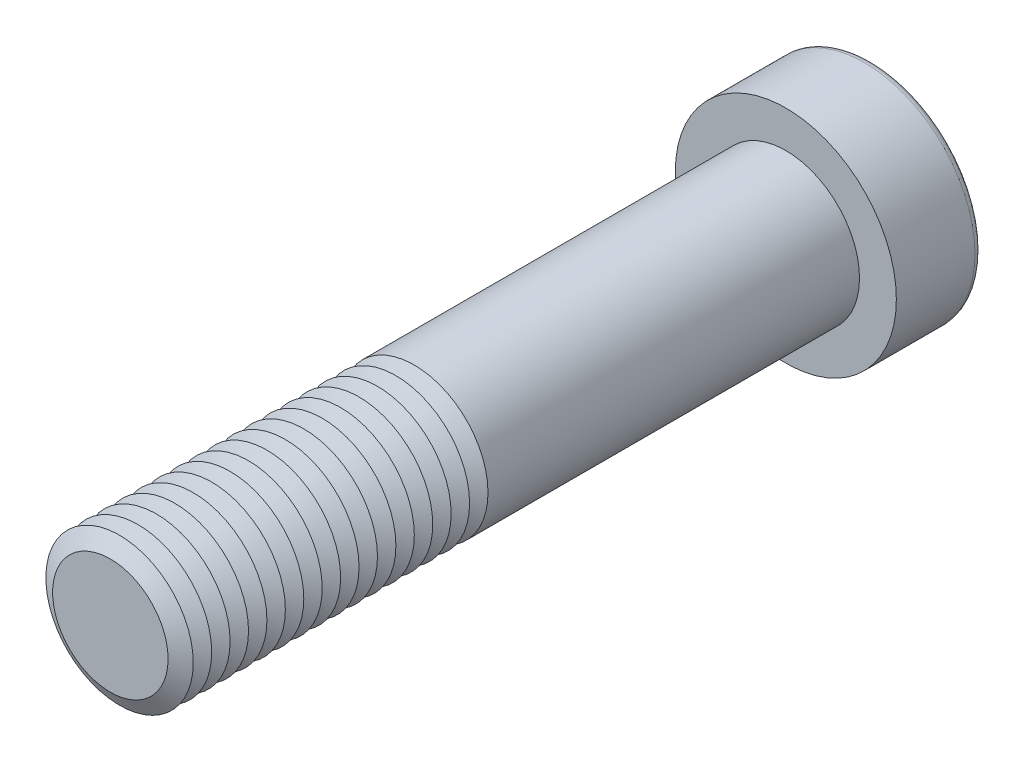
ISO-10303-21;
HEADER;
FILE_DESCRIPTION(('STEP AP214'),'2;1');
FILE_NAME('part.step','',(''),(''),'','','');
FILE_SCHEMA(('AUTOMOTIVE_DESIGN { 1 0 10303 214 1 1 1 1 }'));
ENDSEC;
DATA;
#1=APPLICATION_CONTEXT('core data for automotive mechanical design processes');
#2=APPLICATION_PROTOCOL_DEFINITION('international standard','automotive_design',2000,#1);
#3=PRODUCT_CONTEXT('',#1,'mechanical');
#4=PRODUCT('Part','Part','',(#3));
#5=PRODUCT_RELATED_PRODUCT_CATEGORY('part','',(#4));
#6=PRODUCT_DEFINITION_FORMATION('','',#4);
#7=PRODUCT_DEFINITION_CONTEXT('part definition',#1,'design');
#8=PRODUCT_DEFINITION('design','',#6,#7);
#9=PRODUCT_DEFINITION_SHAPE('','',#8);
#10=(LENGTH_UNIT() NAMED_UNIT(*) SI_UNIT(.MILLI.,.METRE.));
#11=(NAMED_UNIT(*) PLANE_ANGLE_UNIT() SI_UNIT($,.RADIAN.));
#12=(NAMED_UNIT(*) SI_UNIT($,.STERADIAN.) SOLID_ANGLE_UNIT());
#13=UNCERTAINTY_MEASURE_WITH_UNIT(LENGTH_MEASURE(1.E-05),#10,'distance_accuracy_value','');
#14=(GEOMETRIC_REPRESENTATION_CONTEXT(3) GLOBAL_UNCERTAINTY_ASSIGNED_CONTEXT((#13)) GLOBAL_UNIT_ASSIGNED_CONTEXT((#10,
#11,#12)) REPRESENTATION_CONTEXT('',''));
#15=CARTESIAN_POINT('',(0.,0.,0.));
#16=DIRECTION('',(0.,0.,1.));
#17=DIRECTION('',(1.,0.,0.));
#18=AXIS2_PLACEMENT_3D('',#15,#16,#17);
#19=CARTESIAN_POINT('',(0.,0.,99.5));
#20=DIRECTION('',(0.,0.,1.));
#21=DIRECTION('',(1.,0.,0.));
#22=AXIS2_PLACEMENT_3D('',#19,#20,#21);
#23=CONICAL_SURFACE('',#22,12.,1.0471975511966);
#24=CARTESIAN_POINT('',(0.,0.,98.));
#25=DIRECTION('',(0.,0.,1.));
#26=DIRECTION('',(1.,0.,0.));
#27=AXIS2_PLACEMENT_3D('',#24,#25,#26);
#28=CIRCLE('',#27,9.40192378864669);
#29=CARTESIAN_POINT('',(9.40192378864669,0.,98.));
#30=VERTEX_POINT('',#29);
#31=EDGE_CURVE('E312',#30,#30,#28,.T.);
#32=ORIENTED_EDGE('',*,*,#31,.T.);
#33=EDGE_LOOP('',(#32));
#34=FACE_BOUND('',#33,.T.);
#35=CARTESIAN_POINT('',(0.,0.,99.5));
#36=DIRECTION('',(0.,0.,1.));
#37=DIRECTION('',(1.,0.,0.));
#38=AXIS2_PLACEMENT_3D('',#35,#36,#37);
#39=CIRCLE('',#38,12.);
#40=CARTESIAN_POINT('',(12.,0.,99.5));
#41=VERTEX_POINT('',#40);
#42=EDGE_CURVE('E315',#41,#41,#39,.T.);
#43=ORIENTED_EDGE('',*,*,#42,.F.);
#44=EDGE_LOOP('',(#43));
#45=FACE_BOUND('',#44,.T.);
#46=ADVANCED_FACE('F39',(#34,#45),#23,.T.);
#47=CARTESIAN_POINT('',(0.,0.,98.));
#48=DIRECTION('',(0.,0.,-1.));
#49=DIRECTION('',(-1.,0.,0.));
#50=AXIS2_PLACEMENT_3D('',#47,#48,#49);
#51=CONICAL_SURFACE('',#50,9.40192378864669,1.0471975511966);
#52=CARTESIAN_POINT('',(0.,0.,96.5));
#53=DIRECTION('',(0.,0.,1.));
#54=DIRECTION('',(1.,0.,0.));
#55=AXIS2_PLACEMENT_3D('',#52,#53,#54);
#56=CIRCLE('',#55,12.);
#57=CARTESIAN_POINT('',(12.,0.,96.5));
#58=VERTEX_POINT('',#57);
#59=EDGE_CURVE('E323',#58,#58,#56,.T.);
#60=ORIENTED_EDGE('',*,*,#59,.T.);
#61=EDGE_LOOP('',(#60));
#62=FACE_BOUND('',#61,.T.);
#63=ORIENTED_EDGE('',*,*,#31,.F.);
#64=EDGE_LOOP('',(#63));
#65=FACE_BOUND('',#64,.T.);
#66=ADVANCED_FACE('F244',(#62,#65),#51,.T.);
#67=CARTESIAN_POINT('',(0.,0.,110.));
#68=DIRECTION('',(0.,0.,1.));
#69=DIRECTION('',(1.,0.,0.));
#70=AXIS2_PLACEMENT_3D('',#67,#68,#69);
#71=PLANE('',#70);
#72=CARTESIAN_POINT('',(0.,0.,110.));
#73=DIRECTION('',(0.,0.,1.));
#74=DIRECTION('',(1.,0.,0.));
#75=AXIS2_PLACEMENT_3D('',#72,#73,#74);
#76=CIRCLE('',#75,9.40192378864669);
#77=CARTESIAN_POINT('',(9.40192378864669,0.,110.));
#78=VERTEX_POINT('',#77);
#79=EDGE_CURVE('E173',#78,#78,#76,.T.);
#80=ORIENTED_EDGE('',*,*,#79,.T.);
#81=EDGE_LOOP('',(#80));
#82=FACE_BOUND('',#81,.T.);
#83=ADVANCED_FACE('F250',(#82),#71,.T.);
#84=CARTESIAN_POINT('',(0.,0.,110.));
#85=DIRECTION('',(0.,0.,-1.));
#86=DIRECTION('',(-1.,0.,0.));
#87=AXIS2_PLACEMENT_3D('',#84,#85,#86);
#88=CONICAL_SURFACE('',#87,9.40192378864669,1.0471975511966);
#89=CARTESIAN_POINT('',(0.,0.,108.5));
#90=DIRECTION('',(0.,0.,1.));
#91=DIRECTION('',(1.,0.,0.));
#92=AXIS2_PLACEMENT_3D('',#89,#90,#91);
#93=CIRCLE('',#92,12.);
#94=CARTESIAN_POINT('',(12.,0.,108.5));
#95=VERTEX_POINT('',#94);
#96=EDGE_CURVE('E290',#95,#95,#93,.T.);
#97=ORIENTED_EDGE('',*,*,#96,.T.);
#98=EDGE_LOOP('',(#97));
#99=FACE_BOUND('',#98,.T.);
#100=ORIENTED_EDGE('',*,*,#79,.F.);
#101=EDGE_LOOP('',(#100));
#102=FACE_BOUND('',#101,.T.);
#103=ADVANCED_FACE('F198',(#99,#102),#88,.T.);
#104=CARTESIAN_POINT('',(0.,0.,108.5));
#105=DIRECTION('',(0.,0.,1.));
#106=DIRECTION('',(1.,0.,0.));
#107=AXIS2_PLACEMENT_3D('',#104,#105,#106);
#108=CONICAL_SURFACE('',#107,12.,1.0471975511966);
#109=CARTESIAN_POINT('',(0.,0.,107.));
#110=DIRECTION('',(0.,0.,1.));
#111=DIRECTION('',(1.,0.,0.));
#112=AXIS2_PLACEMENT_3D('',#109,#110,#111);
#113=CIRCLE('',#112,9.40192378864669);
#114=CARTESIAN_POINT('',(9.40192378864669,0.,107.));
#115=VERTEX_POINT('',#114);
#116=EDGE_CURVE('E287',#115,#115,#113,.T.);
#117=ORIENTED_EDGE('',*,*,#116,.T.);
#118=EDGE_LOOP('',(#117));
#119=FACE_BOUND('',#118,.T.);
#120=ORIENTED_EDGE('',*,*,#96,.F.);
#121=EDGE_LOOP('',(#120));
#122=FACE_BOUND('',#121,.T.);
#123=ADVANCED_FACE('F276',(#119,#122),#108,.T.);
#124=CARTESIAN_POINT('',(0.,0.,107.));
#125=DIRECTION('',(0.,0.,-1.));
#126=DIRECTION('',(-1.,0.,0.));
#127=AXIS2_PLACEMENT_3D('',#124,#125,#126);
#128=CONICAL_SURFACE('',#127,9.40192378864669,1.0471975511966);
#129=CARTESIAN_POINT('',(0.,0.,105.5));
#130=DIRECTION('',(0.,0.,1.));
#131=DIRECTION('',(1.,0.,0.));
#132=AXIS2_PLACEMENT_3D('',#129,#130,#131);
#133=CIRCLE('',#132,12.);
#134=CARTESIAN_POINT('',(12.,0.,105.5));
#135=VERTEX_POINT('',#134);
#136=EDGE_CURVE('E298',#135,#135,#133,.T.);
#137=ORIENTED_EDGE('',*,*,#136,.T.);
#138=EDGE_LOOP('',(#137));
#139=FACE_BOUND('',#138,.T.);
#140=ORIENTED_EDGE('',*,*,#116,.F.);
#141=EDGE_LOOP('',(#140));
#142=FACE_BOUND('',#141,.T.);
#143=ADVANCED_FACE('F273',(#139,#142),#128,.T.);
#144=CARTESIAN_POINT('',(0.,0.,105.5));
#145=DIRECTION('',(0.,0.,1.));
#146=DIRECTION('',(1.,0.,0.));
#147=AXIS2_PLACEMENT_3D('',#144,#145,#146);
#148=CONICAL_SURFACE('',#147,12.,1.0471975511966);
#149=CARTESIAN_POINT('',(0.,0.,104.));
#150=DIRECTION('',(0.,0.,1.));
#151=DIRECTION('',(1.,0.,0.));
#152=AXIS2_PLACEMENT_3D('',#149,#150,#151);
#153=CIRCLE('',#152,9.40192378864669);
#154=CARTESIAN_POINT('',(9.40192378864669,0.,104.));
#155=VERTEX_POINT('',#154);
#156=EDGE_CURVE('E292',#155,#155,#153,.T.);
#157=ORIENTED_EDGE('',*,*,#156,.T.);
#158=EDGE_LOOP('',(#157));
#159=FACE_BOUND('',#158,.T.);
#160=ORIENTED_EDGE('',*,*,#136,.F.);
#161=EDGE_LOOP('',(#160));
#162=FACE_BOUND('',#161,.T.);
#163=ADVANCED_FACE('F269',(#159,#162),#148,.T.);
#164=CARTESIAN_POINT('',(0.,0.,104.));
#165=DIRECTION('',(0.,0.,-1.));
#166=DIRECTION('',(-1.,0.,0.));
#167=AXIS2_PLACEMENT_3D('',#164,#165,#166);
#168=CONICAL_SURFACE('',#167,9.40192378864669,1.0471975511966);
#169=CARTESIAN_POINT('',(0.,0.,102.5));
#170=DIRECTION('',(0.,0.,1.));
#171=DIRECTION('',(1.,0.,0.));
#172=AXIS2_PLACEMENT_3D('',#169,#170,#171);
#173=CIRCLE('',#172,12.);
#174=CARTESIAN_POINT('',(12.,0.,102.5));
#175=VERTEX_POINT('',#174);
#176=EDGE_CURVE('E308',#175,#175,#173,.T.);
#177=ORIENTED_EDGE('',*,*,#176,.T.);
#178=EDGE_LOOP('',(#177));
#179=FACE_BOUND('',#178,.T.);
#180=ORIENTED_EDGE('',*,*,#156,.F.);
#181=EDGE_LOOP('',(#180));
#182=FACE_BOUND('',#181,.T.);
#183=ADVANCED_FACE('F265',(#179,#182),#168,.T.);
#184=CARTESIAN_POINT('',(0.,0.,102.5));
#185=DIRECTION('',(0.,0.,1.));
#186=DIRECTION('',(1.,0.,0.));
#187=AXIS2_PLACEMENT_3D('',#184,#185,#186);
#188=CONICAL_SURFACE('',#187,12.,1.0471975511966);
#189=CARTESIAN_POINT('',(0.,0.,101.));
#190=DIRECTION('',(0.,0.,1.));
#191=DIRECTION('',(1.,0.,0.));
#192=AXIS2_PLACEMENT_3D('',#189,#190,#191);
#193=CIRCLE('',#192,9.40192378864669);
#194=CARTESIAN_POINT('',(9.40192378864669,0.,101.));
#195=VERTEX_POINT('',#194);
#196=EDGE_CURVE('E304',#195,#195,#193,.T.);
#197=ORIENTED_EDGE('',*,*,#196,.T.);
#198=EDGE_LOOP('',(#197));
#199=FACE_BOUND('',#198,.T.);
#200=ORIENTED_EDGE('',*,*,#176,.F.);
#201=EDGE_LOOP('',(#200));
#202=FACE_BOUND('',#201,.T.);
#203=ADVANCED_FACE('F261',(#199,#202),#188,.T.);
#204=CARTESIAN_POINT('',(0.,0.,101.));
#205=DIRECTION('',(0.,0.,-1.));
#206=DIRECTION('',(-1.,0.,0.));
#207=AXIS2_PLACEMENT_3D('',#204,#205,#206);
#208=CONICAL_SURFACE('',#207,9.40192378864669,1.0471975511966);
#209=ORIENTED_EDGE('',*,*,#42,.T.);
#210=EDGE_LOOP('',(#209));
#211=FACE_BOUND('',#210,.T.);
#212=ORIENTED_EDGE('',*,*,#196,.F.);
#213=EDGE_LOOP('',(#212));
#214=FACE_BOUND('',#213,.T.);
#215=ADVANCED_FACE('F257',(#211,#214),#208,.T.);
#216=CARTESIAN_POINT('',(0.,0.,96.5));
#217=DIRECTION('',(0.,0.,1.));
#218=DIRECTION('',(1.,0.,0.));
#219=AXIS2_PLACEMENT_3D('',#216,#217,#218);
#220=CONICAL_SURFACE('',#219,12.,1.0471975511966);
#221=CARTESIAN_POINT('',(0.,0.,95.));
#222=DIRECTION('',(0.,0.,1.));
#223=DIRECTION('',(1.,0.,0.));
#224=AXIS2_PLACEMENT_3D('',#221,#222,#223);
#225=CIRCLE('',#224,9.40192378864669);
#226=CARTESIAN_POINT('',(9.40192378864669,0.,95.));
#227=VERTEX_POINT('',#226);
#228=EDGE_CURVE('E319',#227,#227,#225,.T.);
#229=ORIENTED_EDGE('',*,*,#228,.T.);
#230=EDGE_LOOP('',(#229));
#231=FACE_BOUND('',#230,.T.);
#232=ORIENTED_EDGE('',*,*,#59,.F.);
#233=EDGE_LOOP('',(#232));
#234=FACE_BOUND('',#233,.T.);
#235=ADVANCED_FACE('F260',(#231,#234),#220,.T.);
#236=CARTESIAN_POINT('',(0.,0.,95.));
#237=DIRECTION('',(0.,0.,-1.));
#238=DIRECTION('',(-1.,0.,0.));
#239=AXIS2_PLACEMENT_3D('',#236,#237,#238);
#240=CONICAL_SURFACE('',#239,9.40192378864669,1.0471975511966);
#241=CARTESIAN_POINT('',(0.,0.,93.5));
#242=DIRECTION('',(0.,0.,1.));
#243=DIRECTION('',(1.,0.,0.));
#244=AXIS2_PLACEMENT_3D('',#241,#242,#243);
#245=CIRCLE('',#244,12.);
#246=CARTESIAN_POINT('',(12.,0.,93.5));
#247=VERTEX_POINT('',#246);
#248=EDGE_CURVE('E331',#247,#247,#245,.T.);
#249=ORIENTED_EDGE('',*,*,#248,.T.);
#250=EDGE_LOOP('',(#249));
#251=FACE_BOUND('',#250,.T.);
#252=ORIENTED_EDGE('',*,*,#228,.F.);
#253=EDGE_LOOP('',(#252));
#254=FACE_BOUND('',#253,.T.);
#255=ADVANCED_FACE('F512',(#251,#254),#240,.T.);
#256=CARTESIAN_POINT('',(0.,0.,93.5));
#257=DIRECTION('',(0.,0.,1.));
#258=DIRECTION('',(1.,0.,0.));
#259=AXIS2_PLACEMENT_3D('',#256,#257,#258);
#260=CONICAL_SURFACE('',#259,12.,1.0471975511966);
#261=CARTESIAN_POINT('',(0.,0.,92.));
#262=DIRECTION('',(0.,0.,1.));
#263=DIRECTION('',(1.,0.,0.));
#264=AXIS2_PLACEMENT_3D('',#261,#262,#263);
#265=CIRCLE('',#264,9.40192378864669);
#266=CARTESIAN_POINT('',(9.40192378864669,0.,92.));
#267=VERTEX_POINT('',#266);
#268=EDGE_CURVE('E327',#267,#267,#265,.T.);
#269=ORIENTED_EDGE('',*,*,#268,.T.);
#270=EDGE_LOOP('',(#269));
#271=FACE_BOUND('',#270,.T.);
#272=ORIENTED_EDGE('',*,*,#248,.F.);
#273=EDGE_LOOP('',(#272));
#274=FACE_BOUND('',#273,.T.);
#275=ADVANCED_FACE('F508',(#271,#274),#260,.T.);
#276=CARTESIAN_POINT('',(0.,0.,92.));
#277=DIRECTION('',(0.,0.,-1.));
#278=DIRECTION('',(-1.,0.,0.));
#279=AXIS2_PLACEMENT_3D('',#276,#277,#278);
#280=CONICAL_SURFACE('',#279,9.40192378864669,1.0471975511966);
#281=CARTESIAN_POINT('',(0.,0.,90.5));
#282=DIRECTION('',(0.,0.,1.));
#283=DIRECTION('',(1.,0.,0.));
#284=AXIS2_PLACEMENT_3D('',#281,#282,#283);
#285=CIRCLE('',#284,12.);
#286=CARTESIAN_POINT('',(12.,0.,90.5));
#287=VERTEX_POINT('',#286);
#288=EDGE_CURVE('E339',#287,#287,#285,.T.);
#289=ORIENTED_EDGE('',*,*,#288,.T.);
#290=EDGE_LOOP('',(#289));
#291=FACE_BOUND('',#290,.T.);
#292=ORIENTED_EDGE('',*,*,#268,.F.);
#293=EDGE_LOOP('',(#292));
#294=FACE_BOUND('',#293,.T.);
#295=ADVANCED_FACE('F504',(#291,#294),#280,.T.);
#296=CARTESIAN_POINT('',(0.,0.,90.5));
#297=DIRECTION('',(0.,0.,1.));
#298=DIRECTION('',(1.,0.,0.));
#299=AXIS2_PLACEMENT_3D('',#296,#297,#298);
#300=CONICAL_SURFACE('',#299,12.,1.0471975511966);
#301=CARTESIAN_POINT('',(0.,0.,89.));
#302=DIRECTION('',(0.,0.,1.));
#303=DIRECTION('',(1.,0.,0.));
#304=AXIS2_PLACEMENT_3D('',#301,#302,#303);
#305=CIRCLE('',#304,9.40192378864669);
#306=CARTESIAN_POINT('',(9.40192378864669,0.,89.));
#307=VERTEX_POINT('',#306);
#308=EDGE_CURVE('E335',#307,#307,#305,.T.);
#309=ORIENTED_EDGE('',*,*,#308,.T.);
#310=EDGE_LOOP('',(#309));
#311=FACE_BOUND('',#310,.T.);
#312=ORIENTED_EDGE('',*,*,#288,.F.);
#313=EDGE_LOOP('',(#312));
#314=FACE_BOUND('',#313,.T.);
#315=ADVANCED_FACE('F500',(#311,#314),#300,.T.);
#316=CARTESIAN_POINT('',(0.,0.,89.));
#317=DIRECTION('',(0.,0.,-1.));
#318=DIRECTION('',(-1.,0.,0.));
#319=AXIS2_PLACEMENT_3D('',#316,#317,#318);
#320=CONICAL_SURFACE('',#319,9.40192378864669,1.0471975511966);
#321=CARTESIAN_POINT('',(0.,0.,87.5));
#322=DIRECTION('',(0.,0.,1.));
#323=DIRECTION('',(1.,0.,0.));
#324=AXIS2_PLACEMENT_3D('',#321,#322,#323);
#325=CIRCLE('',#324,12.);
#326=CARTESIAN_POINT('',(12.,0.,87.5));
#327=VERTEX_POINT('',#326);
#328=EDGE_CURVE('E347',#327,#327,#325,.T.);
#329=ORIENTED_EDGE('',*,*,#328,.T.);
#330=EDGE_LOOP('',(#329));
#331=FACE_BOUND('',#330,.T.);
#332=ORIENTED_EDGE('',*,*,#308,.F.);
#333=EDGE_LOOP('',(#332));
#334=FACE_BOUND('',#333,.T.);
#335=ADVANCED_FACE('F496',(#331,#334),#320,.T.);
#336=CARTESIAN_POINT('',(0.,0.,87.5));
#337=DIRECTION('',(0.,0.,1.));
#338=DIRECTION('',(1.,0.,0.));
#339=AXIS2_PLACEMENT_3D('',#336,#337,#338);
#340=CONICAL_SURFACE('',#339,12.,1.0471975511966);
#341=CARTESIAN_POINT('',(0.,0.,86.));
#342=DIRECTION('',(0.,0.,1.));
#343=DIRECTION('',(1.,0.,0.));
#344=AXIS2_PLACEMENT_3D('',#341,#342,#343);
#345=CIRCLE('',#344,9.40192378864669);
#346=CARTESIAN_POINT('',(9.40192378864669,0.,86.));
#347=VERTEX_POINT('',#346);
#348=EDGE_CURVE('E343',#347,#347,#345,.T.);
#349=ORIENTED_EDGE('',*,*,#348,.T.);
#350=EDGE_LOOP('',(#349));
#351=FACE_BOUND('',#350,.T.);
#352=ORIENTED_EDGE('',*,*,#328,.F.);
#353=EDGE_LOOP('',(#352));
#354=FACE_BOUND('',#353,.T.);
#355=ADVANCED_FACE('F492',(#351,#354),#340,.T.);
#356=CARTESIAN_POINT('',(0.,0.,86.));
#357=DIRECTION('',(0.,0.,-1.));
#358=DIRECTION('',(-1.,0.,0.));
#359=AXIS2_PLACEMENT_3D('',#356,#357,#358);
#360=CONICAL_SURFACE('',#359,9.40192378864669,1.0471975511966);
#361=CARTESIAN_POINT('',(0.,0.,84.5));
#362=DIRECTION('',(0.,0.,1.));
#363=DIRECTION('',(1.,0.,0.));
#364=AXIS2_PLACEMENT_3D('',#361,#362,#363);
#365=CIRCLE('',#364,12.);
#366=CARTESIAN_POINT('',(12.,0.,84.5));
#367=VERTEX_POINT('',#366);
#368=EDGE_CURVE('E355',#367,#367,#365,.T.);
#369=ORIENTED_EDGE('',*,*,#368,.T.);
#370=EDGE_LOOP('',(#369));
#371=FACE_BOUND('',#370,.T.);
#372=ORIENTED_EDGE('',*,*,#348,.F.);
#373=EDGE_LOOP('',(#372));
#374=FACE_BOUND('',#373,.T.);
#375=ADVANCED_FACE('F488',(#371,#374),#360,.T.);
#376=CARTESIAN_POINT('',(0.,0.,84.5));
#377=DIRECTION('',(0.,0.,1.));
#378=DIRECTION('',(1.,0.,0.));
#379=AXIS2_PLACEMENT_3D('',#376,#377,#378);
#380=CONICAL_SURFACE('',#379,12.,1.0471975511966);
#381=CARTESIAN_POINT('',(0.,0.,83.));
#382=DIRECTION('',(0.,0.,1.));
#383=DIRECTION('',(1.,0.,0.));
#384=AXIS2_PLACEMENT_3D('',#381,#382,#383);
#385=CIRCLE('',#384,9.40192378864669);
#386=CARTESIAN_POINT('',(9.40192378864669,0.,83.));
#387=VERTEX_POINT('',#386);
#388=EDGE_CURVE('E351',#387,#387,#385,.T.);
#389=ORIENTED_EDGE('',*,*,#388,.T.);
#390=EDGE_LOOP('',(#389));
#391=FACE_BOUND('',#390,.T.);
#392=ORIENTED_EDGE('',*,*,#368,.F.);
#393=EDGE_LOOP('',(#392));
#394=FACE_BOUND('',#393,.T.);
#395=ADVANCED_FACE('F484',(#391,#394),#380,.T.);
#396=CARTESIAN_POINT('',(0.,0.,83.));
#397=DIRECTION('',(0.,0.,-1.));
#398=DIRECTION('',(-1.,0.,0.));
#399=AXIS2_PLACEMENT_3D('',#396,#397,#398);
#400=CONICAL_SURFACE('',#399,9.40192378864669,1.0471975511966);
#401=CARTESIAN_POINT('',(0.,0.,81.5));
#402=DIRECTION('',(0.,0.,1.));
#403=DIRECTION('',(1.,0.,0.));
#404=AXIS2_PLACEMENT_3D('',#401,#402,#403);
#405=CIRCLE('',#404,12.);
#406=CARTESIAN_POINT('',(12.,0.,81.5));
#407=VERTEX_POINT('',#406);
#408=EDGE_CURVE('E363',#407,#407,#405,.T.);
#409=ORIENTED_EDGE('',*,*,#408,.T.);
#410=EDGE_LOOP('',(#409));
#411=FACE_BOUND('',#410,.T.);
#412=ORIENTED_EDGE('',*,*,#388,.F.);
#413=EDGE_LOOP('',(#412));
#414=FACE_BOUND('',#413,.T.);
#415=ADVANCED_FACE('F480',(#411,#414),#400,.T.);
#416=CARTESIAN_POINT('',(0.,0.,81.5));
#417=DIRECTION('',(0.,0.,1.));
#418=DIRECTION('',(1.,0.,0.));
#419=AXIS2_PLACEMENT_3D('',#416,#417,#418);
#420=CONICAL_SURFACE('',#419,12.,1.0471975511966);
#421=CARTESIAN_POINT('',(0.,0.,80.));
#422=DIRECTION('',(0.,0.,1.));
#423=DIRECTION('',(1.,0.,0.));
#424=AXIS2_PLACEMENT_3D('',#421,#422,#423);
#425=CIRCLE('',#424,9.40192378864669);
#426=CARTESIAN_POINT('',(9.40192378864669,0.,80.));
#427=VERTEX_POINT('',#426);
#428=EDGE_CURVE('E359',#427,#427,#425,.T.);
#429=ORIENTED_EDGE('',*,*,#428,.T.);
#430=EDGE_LOOP('',(#429));
#431=FACE_BOUND('',#430,.T.);
#432=ORIENTED_EDGE('',*,*,#408,.F.);
#433=EDGE_LOOP('',(#432));
#434=FACE_BOUND('',#433,.T.);
#435=ADVANCED_FACE('F476',(#431,#434),#420,.T.);
#436=CARTESIAN_POINT('',(0.,0.,80.));
#437=DIRECTION('',(0.,0.,-1.));
#438=DIRECTION('',(-1.,0.,0.));
#439=AXIS2_PLACEMENT_3D('',#436,#437,#438);
#440=CONICAL_SURFACE('',#439,9.40192378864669,1.0471975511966);
#441=CARTESIAN_POINT('',(0.,0.,78.5));
#442=DIRECTION('',(0.,0.,1.));
#443=DIRECTION('',(1.,0.,0.));
#444=AXIS2_PLACEMENT_3D('',#441,#442,#443);
#445=CIRCLE('',#444,12.);
#446=CARTESIAN_POINT('',(12.,0.,78.5));
#447=VERTEX_POINT('',#446);
#448=EDGE_CURVE('E371',#447,#447,#445,.T.);
#449=ORIENTED_EDGE('',*,*,#448,.T.);
#450=EDGE_LOOP('',(#449));
#451=FACE_BOUND('',#450,.T.);
#452=ORIENTED_EDGE('',*,*,#428,.F.);
#453=EDGE_LOOP('',(#452));
#454=FACE_BOUND('',#453,.T.);
#455=ADVANCED_FACE('F472',(#451,#454),#440,.T.);
#456=CARTESIAN_POINT('',(0.,0.,78.5));
#457=DIRECTION('',(0.,0.,1.));
#458=DIRECTION('',(1.,0.,0.));
#459=AXIS2_PLACEMENT_3D('',#456,#457,#458);
#460=CONICAL_SURFACE('',#459,12.,1.0471975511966);
#461=CARTESIAN_POINT('',(0.,0.,77.));
#462=DIRECTION('',(0.,0.,1.));
#463=DIRECTION('',(1.,0.,0.));
#464=AXIS2_PLACEMENT_3D('',#461,#462,#463);
#465=CIRCLE('',#464,9.40192378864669);
#466=CARTESIAN_POINT('',(9.40192378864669,0.,77.));
#467=VERTEX_POINT('',#466);
#468=EDGE_CURVE('E367',#467,#467,#465,.T.);
#469=ORIENTED_EDGE('',*,*,#468,.T.);
#470=EDGE_LOOP('',(#469));
#471=FACE_BOUND('',#470,.T.);
#472=ORIENTED_EDGE('',*,*,#448,.F.);
#473=EDGE_LOOP('',(#472));
#474=FACE_BOUND('',#473,.T.);
#475=ADVANCED_FACE('F468',(#471,#474),#460,.T.);
#476=CARTESIAN_POINT('',(0.,0.,77.));
#477=DIRECTION('',(0.,0.,-1.));
#478=DIRECTION('',(-1.,0.,0.));
#479=AXIS2_PLACEMENT_3D('',#476,#477,#478);
#480=CONICAL_SURFACE('',#479,9.40192378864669,1.0471975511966);
#481=CARTESIAN_POINT('',(0.,0.,75.5));
#482=DIRECTION('',(0.,0.,1.));
#483=DIRECTION('',(1.,0.,0.));
#484=AXIS2_PLACEMENT_3D('',#481,#482,#483);
#485=CIRCLE('',#484,12.);
#486=CARTESIAN_POINT('',(12.,0.,75.5));
#487=VERTEX_POINT('',#486);
#488=EDGE_CURVE('E379',#487,#487,#485,.T.);
#489=ORIENTED_EDGE('',*,*,#488,.T.);
#490=EDGE_LOOP('',(#489));
#491=FACE_BOUND('',#490,.T.);
#492=ORIENTED_EDGE('',*,*,#468,.F.);
#493=EDGE_LOOP('',(#492));
#494=FACE_BOUND('',#493,.T.);
#495=ADVANCED_FACE('F464',(#491,#494),#480,.T.);
#496=CARTESIAN_POINT('',(0.,0.,75.5));
#497=DIRECTION('',(0.,0.,1.));
#498=DIRECTION('',(1.,0.,0.));
#499=AXIS2_PLACEMENT_3D('',#496,#497,#498);
#500=CONICAL_SURFACE('',#499,12.,1.0471975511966);
#501=CARTESIAN_POINT('',(0.,0.,74.));
#502=DIRECTION('',(0.,0.,1.));
#503=DIRECTION('',(1.,0.,0.));
#504=AXIS2_PLACEMENT_3D('',#501,#502,#503);
#505=CIRCLE('',#504,9.40192378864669);
#506=CARTESIAN_POINT('',(9.40192378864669,0.,74.));
#507=VERTEX_POINT('',#506);
#508=EDGE_CURVE('E375',#507,#507,#505,.T.);
#509=ORIENTED_EDGE('',*,*,#508,.T.);
#510=EDGE_LOOP('',(#509));
#511=FACE_BOUND('',#510,.T.);
#512=ORIENTED_EDGE('',*,*,#488,.F.);
#513=EDGE_LOOP('',(#512));
#514=FACE_BOUND('',#513,.T.);
#515=ADVANCED_FACE('F460',(#511,#514),#500,.T.);
#516=CARTESIAN_POINT('',(0.,0.,74.));
#517=DIRECTION('',(0.,0.,-1.));
#518=DIRECTION('',(-1.,0.,0.));
#519=AXIS2_PLACEMENT_3D('',#516,#517,#518);
#520=CONICAL_SURFACE('',#519,9.40192378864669,1.0471975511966);
#521=CARTESIAN_POINT('',(0.,0.,72.5));
#522=DIRECTION('',(0.,0.,1.));
#523=DIRECTION('',(1.,0.,0.));
#524=AXIS2_PLACEMENT_3D('',#521,#522,#523);
#525=CIRCLE('',#524,12.);
#526=CARTESIAN_POINT('',(12.,0.,72.5));
#527=VERTEX_POINT('',#526);
#528=EDGE_CURVE('E386',#527,#527,#525,.T.);
#529=ORIENTED_EDGE('',*,*,#528,.T.);
#530=EDGE_LOOP('',(#529));
#531=FACE_BOUND('',#530,.T.);
#532=ORIENTED_EDGE('',*,*,#508,.F.);
#533=EDGE_LOOP('',(#532));
#534=FACE_BOUND('',#533,.T.);
#535=ADVANCED_FACE('F456',(#531,#534),#520,.T.);
#536=CARTESIAN_POINT('',(0.,0.,72.5));
#537=DIRECTION('',(0.,0.,1.));
#538=DIRECTION('',(1.,0.,0.));
#539=AXIS2_PLACEMENT_3D('',#536,#537,#538);
#540=CONICAL_SURFACE('',#539,12.,1.0471975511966);
#541=CARTESIAN_POINT('',(0.,0.,71.));
#542=DIRECTION('',(0.,0.,1.));
#543=DIRECTION('',(1.,0.,0.));
#544=AXIS2_PLACEMENT_3D('',#541,#542,#543);
#545=CIRCLE('',#544,9.40192378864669);
#546=CARTESIAN_POINT('',(9.40192378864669,0.,71.));
#547=VERTEX_POINT('',#546);
#548=EDGE_CURVE('E383',#547,#547,#545,.T.);
#549=ORIENTED_EDGE('',*,*,#548,.T.);
#550=EDGE_LOOP('',(#549));
#551=FACE_BOUND('',#550,.T.);
#552=ORIENTED_EDGE('',*,*,#528,.F.);
#553=EDGE_LOOP('',(#552));
#554=FACE_BOUND('',#553,.T.);
#555=ADVANCED_FACE('F452',(#551,#554),#540,.T.);
#556=CARTESIAN_POINT('',(0.,0.,71.));
#557=DIRECTION('',(0.,0.,-1.));
#558=DIRECTION('',(-1.,0.,0.));
#559=AXIS2_PLACEMENT_3D('',#556,#557,#558);
#560=CONICAL_SURFACE('',#559,9.40192378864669,1.0471975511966);
#561=CARTESIAN_POINT('',(0.,0.,69.5));
#562=DIRECTION('',(0.,0.,1.));
#563=DIRECTION('',(1.,0.,0.));
#564=AXIS2_PLACEMENT_3D('',#561,#562,#563);
#565=CIRCLE('',#564,12.);
#566=CARTESIAN_POINT('',(12.,0.,69.5));
#567=VERTEX_POINT('',#566);
#568=EDGE_CURVE('E394',#567,#567,#565,.T.);
#569=ORIENTED_EDGE('',*,*,#568,.T.);
#570=EDGE_LOOP('',(#569));
#571=FACE_BOUND('',#570,.T.);
#572=ORIENTED_EDGE('',*,*,#548,.F.);
#573=EDGE_LOOP('',(#572));
#574=FACE_BOUND('',#573,.T.);
#575=ADVANCED_FACE('F448',(#571,#574),#560,.T.);
#576=CARTESIAN_POINT('',(0.,0.,69.5));
#577=DIRECTION('',(0.,0.,1.));
#578=DIRECTION('',(1.,0.,0.));
#579=AXIS2_PLACEMENT_3D('',#576,#577,#578);
#580=CONICAL_SURFACE('',#579,12.,1.0471975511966);
#581=CARTESIAN_POINT('',(0.,0.,68.));
#582=DIRECTION('',(0.,0.,1.));
#583=DIRECTION('',(1.,0.,0.));
#584=AXIS2_PLACEMENT_3D('',#581,#582,#583);
#585=CIRCLE('',#584,9.40192378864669);
#586=CARTESIAN_POINT('',(9.40192378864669,0.,68.));
#587=VERTEX_POINT('',#586);
#588=EDGE_CURVE('E390',#587,#587,#585,.T.);
#589=ORIENTED_EDGE('',*,*,#588,.T.);
#590=EDGE_LOOP('',(#589));
#591=FACE_BOUND('',#590,.T.);
#592=ORIENTED_EDGE('',*,*,#568,.F.);
#593=EDGE_LOOP('',(#592));
#594=FACE_BOUND('',#593,.T.);
#595=ADVANCED_FACE('F444',(#591,#594),#580,.T.);
#596=CARTESIAN_POINT('',(0.,0.,68.));
#597=DIRECTION('',(0.,0.,-1.));
#598=DIRECTION('',(-1.,0.,0.));
#599=AXIS2_PLACEMENT_3D('',#596,#597,#598);
#600=CONICAL_SURFACE('',#599,9.40192378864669,1.0471975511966);
#601=CARTESIAN_POINT('',(0.,0.,66.5));
#602=DIRECTION('',(0.,0.,1.));
#603=DIRECTION('',(1.,0.,0.));
#604=AXIS2_PLACEMENT_3D('',#601,#602,#603);
#605=CIRCLE('',#604,12.);
#606=CARTESIAN_POINT('',(12.,0.,66.5));
#607=VERTEX_POINT('',#606);
#608=EDGE_CURVE('E402',#607,#607,#605,.T.);
#609=ORIENTED_EDGE('',*,*,#608,.T.);
#610=EDGE_LOOP('',(#609));
#611=FACE_BOUND('',#610,.T.);
#612=ORIENTED_EDGE('',*,*,#588,.F.);
#613=EDGE_LOOP('',(#612));
#614=FACE_BOUND('',#613,.T.);
#615=ADVANCED_FACE('F440',(#611,#614),#600,.T.);
#616=CARTESIAN_POINT('',(0.,0.,66.5));
#617=DIRECTION('',(0.,0.,1.));
#618=DIRECTION('',(1.,0.,0.));
#619=AXIS2_PLACEMENT_3D('',#616,#617,#618);
#620=CONICAL_SURFACE('',#619,12.,1.0471975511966);
#621=CARTESIAN_POINT('',(0.,0.,65.));
#622=DIRECTION('',(0.,0.,1.));
#623=DIRECTION('',(1.,0.,0.));
#624=AXIS2_PLACEMENT_3D('',#621,#622,#623);
#625=CIRCLE('',#624,9.40192378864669);
#626=CARTESIAN_POINT('',(9.40192378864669,0.,65.));
#627=VERTEX_POINT('',#626);
#628=EDGE_CURVE('E398',#627,#627,#625,.T.);
#629=ORIENTED_EDGE('',*,*,#628,.T.);
#630=EDGE_LOOP('',(#629));
#631=FACE_BOUND('',#630,.T.);
#632=ORIENTED_EDGE('',*,*,#608,.F.);
#633=EDGE_LOOP('',(#632));
#634=FACE_BOUND('',#633,.T.);
#635=ADVANCED_FACE('F435',(#631,#634),#620,.T.);
#636=CARTESIAN_POINT('',(0.,0.,65.));
#637=DIRECTION('',(0.,0.,-1.));
#638=DIRECTION('',(-1.,0.,0.));
#639=AXIS2_PLACEMENT_3D('',#636,#637,#638);
#640=CONICAL_SURFACE('',#639,9.40192378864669,1.0471975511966);
#641=CARTESIAN_POINT('',(0.,0.,63.5));
#642=DIRECTION('',(0.,0.,1.));
#643=DIRECTION('',(1.,0.,0.));
#644=AXIS2_PLACEMENT_3D('',#641,#642,#643);
#645=CIRCLE('',#644,12.);
#646=CARTESIAN_POINT('',(12.,0.,63.5));
#647=VERTEX_POINT('',#646);
#648=EDGE_CURVE('E414',#647,#647,#645,.T.);
#649=ORIENTED_EDGE('',*,*,#648,.T.);
#650=EDGE_LOOP('',(#649));
#651=FACE_BOUND('',#650,.T.);
#652=ORIENTED_EDGE('',*,*,#628,.F.);
#653=EDGE_LOOP('',(#652));
#654=FACE_BOUND('',#653,.T.);
#655=ADVANCED_FACE('F421',(#651,#654),#640,.T.);
#656=CARTESIAN_POINT('',(0.,0.,63.5));
#657=DIRECTION('',(0.,0.,1.));
#658=DIRECTION('',(1.,0.,0.));
#659=AXIS2_PLACEMENT_3D('',#656,#657,#658);
#660=CONICAL_SURFACE('',#659,12.,1.0471975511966);
#661=CARTESIAN_POINT('',(0.,0.,62.));
#662=DIRECTION('',(0.,0.,1.));
#663=DIRECTION('',(1.,0.,0.));
#664=AXIS2_PLACEMENT_3D('',#661,#662,#663);
#665=CIRCLE('',#664,9.40192378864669);
#666=CARTESIAN_POINT('',(9.40192378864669,0.,62.));
#667=VERTEX_POINT('',#666);
#668=EDGE_CURVE('E406',#667,#667,#665,.T.);
#669=ORIENTED_EDGE('',*,*,#668,.T.);
#670=EDGE_LOOP('',(#669));
#671=FACE_BOUND('',#670,.T.);
#672=ORIENTED_EDGE('',*,*,#648,.F.);
#673=EDGE_LOOP('',(#672));
#674=FACE_BOUND('',#673,.T.);
#675=ADVANCED_FACE('F424',(#671,#674),#660,.T.);
#676=CARTESIAN_POINT('',(0.,0.,62.));
#677=DIRECTION('',(0.,0.,-1.));
#678=DIRECTION('',(-1.,0.,0.));
#679=AXIS2_PLACEMENT_3D('',#676,#677,#678);
#680=CONICAL_SURFACE('',#679,9.40192378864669,1.0471975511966);
#681=CARTESIAN_POINT('',(0.,0.,60.5));
#682=DIRECTION('',(0.,0.,1.));
#683=DIRECTION('',(1.,0.,0.));
#684=AXIS2_PLACEMENT_3D('',#681,#682,#683);
#685=CIRCLE('',#684,12.);
#686=CARTESIAN_POINT('',(12.,0.,60.5));
#687=VERTEX_POINT('',#686);
#688=EDGE_CURVE('E410',#687,#687,#685,.T.);
#689=ORIENTED_EDGE('',*,*,#688,.T.);
#690=EDGE_LOOP('',(#689));
#691=FACE_BOUND('',#690,.T.);
#692=ORIENTED_EDGE('',*,*,#668,.F.);
#693=EDGE_LOOP('',(#692));
#694=FACE_BOUND('',#693,.T.);
#695=ADVANCED_FACE('F426',(#691,#694),#680,.T.);
#696=CARTESIAN_POINT('',(0.,0.,0.25));
#697=DIRECTION('',(0.,0.,-1.));
#698=DIRECTION('',(-1.,0.,0.));
#699=AXIS2_PLACEMENT_3D('',#696,#697,#698);
#700=CONICAL_SURFACE('',#699,9.5,1.0471975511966);
#701=CARTESIAN_POINT('',(0.,0.,5.73482755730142));
#702=VERTEX_POINT('',#701);
#703=VERTEX_LOOP('',#702);
#704=FACE_BOUND('',#703,.T.);
#705=CARTESIAN_POINT('',(0.,0.,0.25));
#706=DIRECTION('',(0.,0.,-1.));
#707=DIRECTION('',(-1.,0.,0.));
#708=AXIS2_PLACEMENT_3D('',#705,#706,#707);
#709=CIRCLE('',#708,9.5);
#710=CARTESIAN_POINT('',(-8.22724133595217,4.75,0.25));
#711=VERTEX_POINT('',#710);
#712=CARTESIAN_POINT('',(0.,9.5,0.25));
#713=VERTEX_POINT('',#712);
#714=EDGE_CURVE('E149',#711,#713,#709,.T.);
#715=ORIENTED_EDGE('',*,*,#714,.T.);
#716=CARTESIAN_POINT('',(0.,0.,0.25));
#717=DIRECTION('',(0.,0.,-1.));
#718=DIRECTION('',(-1.,0.,0.));
#719=AXIS2_PLACEMENT_3D('',#716,#717,#718);
#720=CIRCLE('',#719,9.5);
#721=CARTESIAN_POINT('',(8.22724133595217,4.75,0.25));
#722=VERTEX_POINT('',#721);
#723=EDGE_CURVE('E54',#713,#722,#720,.T.);
#724=ORIENTED_EDGE('',*,*,#723,.T.);
#725=CARTESIAN_POINT('',(8.22724133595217,-4.75,0.25));
#726=VERTEX_POINT('',#725);
#727=EDGE_CURVE('E1029',#722,#726,#720,.T.);
#728=ORIENTED_EDGE('',*,*,#727,.T.);
#729=CARTESIAN_POINT('',(0.,-9.5,0.25));
#730=VERTEX_POINT('',#729);
#731=EDGE_CURVE('E1027',#726,#730,#720,.T.);
#732=ORIENTED_EDGE('',*,*,#731,.T.);
#733=CARTESIAN_POINT('',(-8.22724133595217,-4.75,0.25));
#734=VERTEX_POINT('',#733);
#735=EDGE_CURVE('E1021',#730,#734,#720,.T.);
#736=ORIENTED_EDGE('',*,*,#735,.T.);
#737=EDGE_CURVE('E1019',#734,#711,#720,.T.);
#738=ORIENTED_EDGE('',*,*,#737,.T.);
#739=EDGE_LOOP('',(#715,#724,#728,#732,#736,#738));
#740=FACE_BOUND('',#739,.T.);
#741=ADVANCED_FACE('F200',(#704,#740),#700,.F.);
#742=CARTESIAN_POINT('',(0.,0.,0.25));
#743=DIRECTION('',(0.,0.,-1.));
#744=DIRECTION('',(-1.,0.,0.));
#745=AXIS2_PLACEMENT_3D('',#742,#743,#744);
#746=PLANE('',#745);
#747=ORIENTED_EDGE('',*,*,#723,.F.);
#748=DIRECTION('',(1.,0.,0.));
#749=VECTOR('',#748,1.);
#750=CARTESIAN_POINT('',(-5.48482755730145,9.5,0.25));
#751=LINE('',#750,#749);
#752=CARTESIAN_POINT('',(5.48482755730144,9.5,0.25));
#753=VERTEX_POINT('',#752);
#754=EDGE_CURVE('E1071',#713,#753,#751,.T.);
#755=ORIENTED_EDGE('',*,*,#754,.T.);
#756=DIRECTION('',(0.5,-0.866025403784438,0.));
#757=VECTOR('',#756,1.);
#758=CARTESIAN_POINT('',(5.48482755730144,9.5,0.25));
#759=LINE('',#758,#757);
#760=EDGE_CURVE('E155',#753,#722,#759,.T.);
#761=ORIENTED_EDGE('',*,*,#760,.T.);
#762=EDGE_LOOP('',(#747,#755,#761));
#763=FACE_BOUND('',#762,.T.);
#764=ADVANCED_FACE('F607',(#763),#746,.T.);
#765=ORIENTED_EDGE('',*,*,#727,.F.);
#766=CARTESIAN_POINT('',(10.9696551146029,0.,0.25));
#767=VERTEX_POINT('',#766);
#768=EDGE_CURVE('E1067',#722,#767,#759,.T.);
#769=ORIENTED_EDGE('',*,*,#768,.T.);
#770=DIRECTION('',(-0.5,-0.866025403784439,0.));
#771=VECTOR('',#770,1.);
#772=CARTESIAN_POINT('',(10.9696551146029,0.,0.25));
#773=LINE('',#772,#771);
#774=EDGE_CURVE('E1039',#767,#726,#773,.T.);
#775=ORIENTED_EDGE('',*,*,#774,.T.);
#776=EDGE_LOOP('',(#765,#769,#775));
#777=FACE_BOUND('',#776,.T.);
#778=ADVANCED_FACE('F617',(#777),#746,.T.);
#779=ORIENTED_EDGE('',*,*,#731,.F.);
#780=CARTESIAN_POINT('',(5.48482755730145,-9.5,0.25));
#781=VERTEX_POINT('',#780);
#782=EDGE_CURVE('E1041',#726,#781,#773,.T.);
#783=ORIENTED_EDGE('',*,*,#782,.T.);
#784=DIRECTION('',(-1.,0.,0.));
#785=VECTOR('',#784,1.);
#786=CARTESIAN_POINT('',(5.48482755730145,-9.5,0.25));
#787=LINE('',#786,#785);
#788=EDGE_CURVE('E993',#781,#730,#787,.T.);
#789=ORIENTED_EDGE('',*,*,#788,.T.);
#790=EDGE_LOOP('',(#779,#783,#789));
#791=FACE_BOUND('',#790,.T.);
#792=ADVANCED_FACE('F627',(#791),#746,.T.);
#793=ORIENTED_EDGE('',*,*,#735,.F.);
#794=CARTESIAN_POINT('',(-5.48482755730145,-9.5,0.25));
#795=VERTEX_POINT('',#794);
#796=EDGE_CURVE('E1035',#730,#795,#787,.T.);
#797=ORIENTED_EDGE('',*,*,#796,.T.);
#798=DIRECTION('',(-0.5,0.866025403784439,0.));
#799=VECTOR('',#798,1.);
#800=CARTESIAN_POINT('',(-5.48482755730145,-9.5,0.25));
#801=LINE('',#800,#799);
#802=EDGE_CURVE('E1037',#795,#734,#801,.T.);
#803=ORIENTED_EDGE('',*,*,#802,.T.);
#804=EDGE_LOOP('',(#793,#797,#803));
#805=FACE_BOUND('',#804,.T.);
#806=ADVANCED_FACE('F635',(#805),#746,.T.);
#807=ORIENTED_EDGE('',*,*,#737,.F.);
#808=CARTESIAN_POINT('',(-10.9696551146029,0.,0.25));
#809=VERTEX_POINT('',#808);
#810=EDGE_CURVE('E1042',#734,#809,#801,.T.);
#811=ORIENTED_EDGE('',*,*,#810,.T.);
#812=DIRECTION('',(0.5,0.866025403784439,0.));
#813=VECTOR('',#812,1.);
#814=CARTESIAN_POINT('',(-10.9696551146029,0.,0.25));
#815=LINE('',#814,#813);
#816=EDGE_CURVE('E158',#809,#711,#815,.T.);
#817=ORIENTED_EDGE('',*,*,#816,.T.);
#818=EDGE_LOOP('',(#807,#811,#817));
#819=FACE_BOUND('',#818,.T.);
#820=ADVANCED_FACE('F230',(#819),#746,.T.);
#821=ORIENTED_EDGE('',*,*,#714,.F.);
#822=CARTESIAN_POINT('',(-5.48482755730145,9.5,0.25));
#823=VERTEX_POINT('',#822);
#824=EDGE_CURVE('E1049',#711,#823,#815,.T.);
#825=ORIENTED_EDGE('',*,*,#824,.T.);
#826=EDGE_CURVE('E1068',#823,#713,#751,.T.);
#827=ORIENTED_EDGE('',*,*,#826,.T.);
#828=EDGE_LOOP('',(#821,#825,#827));
#829=FACE_BOUND('',#828,.T.);
#830=ADVANCED_FACE('F619',(#829),#746,.T.);
#831=CARTESIAN_POINT('',(-5.48482755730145,9.5,0.25));
#832=DIRECTION('',(0.,1.,0.));
#833=DIRECTION('',(0.,0.,1.));
#834=AXIS2_PLACEMENT_3D('',#831,#832,#833);
#835=PLANE('',#834);
#836=DIRECTION('',(0.,0.,-1.));
#837=VECTOR('',#836,1.);
#838=CARTESIAN_POINT('',(-5.48482755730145,9.5,0.25));
#839=LINE('',#838,#837);
#840=CARTESIAN_POINT('',(-5.48482755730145,9.5,-14.));
#841=VERTEX_POINT('',#840);
#842=EDGE_CURVE('E147',#823,#841,#839,.T.);
#843=ORIENTED_EDGE('',*,*,#842,.T.);
#844=CARTESIAN_POINT('',(-14.3184360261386,9.5,-15.6649552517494));
#845=CARTESIAN_POINT('',(-13.8894653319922,9.5,-15.5692031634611));
#846=CARTESIAN_POINT('',(-13.460220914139,9.5,-15.4746548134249));
#847=CARTESIAN_POINT('',(-12.6010505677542,9.5,-15.2886152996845));
#848=CARTESIAN_POINT('',(-12.1711246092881,9.5,-15.1971242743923));
#849=CARTESIAN_POINT('',(-11.3100507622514,9.5,-15.0177651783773));
#850=CARTESIAN_POINT('',(-10.8789020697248,9.5,-14.9299009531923));
#851=CARTESIAN_POINT('',(-10.0156929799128,9.5,-14.7587741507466));
#852=CARTESIAN_POINT('',(-9.5836325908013,9.5,-14.67551153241));
#853=CARTESIAN_POINT('',(-8.72220045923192,9.5,-14.5153788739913));
#854=CARTESIAN_POINT('',(-8.29283790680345,9.5,-14.4384596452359));
#855=CARTESIAN_POINT('',(-7.43292010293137,9.5,-14.2915458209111));
#856=CARTESIAN_POINT('',(-7.0023648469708,9.5,-14.2215512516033));
#857=CARTESIAN_POINT('',(-6.14001360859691,9.5,-14.0901048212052));
#858=CARTESIAN_POINT('',(-5.70821784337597,9.5,-14.0286515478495));
#859=CARTESIAN_POINT('',(-4.84325961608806,9.5,-13.9161318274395));
#860=CARTESIAN_POINT('',(-4.41009715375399,9.5,-13.8650653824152));
#861=CARTESIAN_POINT('',(-3.53757113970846,9.5,-13.7748018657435));
#862=CARTESIAN_POINT('',(-3.09819281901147,9.5,-13.7357454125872));
#863=CARTESIAN_POINT('',(-2.2183738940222,9.5,-13.6722240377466));
#864=CARTESIAN_POINT('',(-1.77793331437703,9.5,-13.6477587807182));
#865=CARTESIAN_POINT('',(-0.896631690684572,9.5,-13.6148480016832));
#866=CARTESIAN_POINT('',(-0.455770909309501,9.5,-13.606395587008));
#867=CARTESIAN_POINT('',(0.425958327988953,9.5,-13.606024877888));
#868=CARTESIAN_POINT('',(0.866826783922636,9.5,-13.614106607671));
#869=CARTESIAN_POINT('',(1.74977048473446,9.5,-13.6463580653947));
#870=CARTESIAN_POINT('',(2.1918432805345,9.5,-13.6705935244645));
#871=CARTESIAN_POINT('',(3.07492453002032,9.5,-13.7337958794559));
#872=CARTESIAN_POINT('',(3.5159329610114,9.5,-13.7727630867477));
#873=CARTESIAN_POINT('',(4.39689734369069,9.5,-13.8635087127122));
#874=CARTESIAN_POINT('',(4.83685243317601,9.5,-13.9152953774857));
#875=CARTESIAN_POINT('',(5.71535222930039,9.5,-14.0295826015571));
#876=CARTESIAN_POINT('',(6.15389693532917,9.5,-14.0920831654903));
#877=CARTESIAN_POINT('',(7.04109045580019,9.5,-14.2276023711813));
#878=CARTESIAN_POINT('',(7.48970345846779,9.5,-14.3008534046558));
#879=CARTESIAN_POINT('',(8.38565999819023,9.5,-14.4547834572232));
#880=CARTESIAN_POINT('',(8.83300349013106,9.5,-14.5354627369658));
#881=CARTESIAN_POINT('',(9.72662836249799,9.5,-14.7027801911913));
#882=CARTESIAN_POINT('',(10.1729095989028,9.5,-14.7894191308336));
#883=CARTESIAN_POINT('',(11.0645098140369,9.5,-14.9674686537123));
#884=CARTESIAN_POINT('',(11.5098288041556,9.5,-15.0588791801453));
#885=CARTESIAN_POINT('',(12.3998049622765,9.5,-15.2455765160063));
#886=CARTESIAN_POINT('',(12.8444618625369,9.5,-15.3408645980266));
#887=CARTESIAN_POINT('',(13.7330947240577,9.5,-15.5345693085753));
#888=CARTESIAN_POINT('',(14.1770706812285,9.5,-15.6329859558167));
#889=CARTESIAN_POINT('',(15.5080689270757,9.5,-15.9320263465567));
#890=CARTESIAN_POINT('',(16.3942355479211,9.5,-16.1364562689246));
#891=CARTESIAN_POINT('',(18.1541693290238,9.5,-16.5497091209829));
#892=CARTESIAN_POINT('',(19.0279562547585,9.5,-16.7584484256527));
#893=CARTESIAN_POINT('',(20.7743818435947,9.5,-17.180754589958));
#894=CARTESIAN_POINT('',(21.647020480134,9.5,-17.3943215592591));
#895=CARTESIAN_POINT('',(23.3902098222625,9.5,-17.8246823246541));
#896=CARTESIAN_POINT('',(24.2607617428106,9.5,-18.0414712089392));
#897=CARTESIAN_POINT('',(25.5660757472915,9.5,-18.3686360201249));
#898=CARTESIAN_POINT('',(26.0010870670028,9.5,-18.4780192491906));
#899=CARTESIAN_POINT('',(26.8709622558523,9.5,-18.6973688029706));
#900=CARTESIAN_POINT('',(27.3058261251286,9.5,-18.8073351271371));
#901=CARTESIAN_POINT('',(27.7406260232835,9.5,-18.9175537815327));
#902=B_SPLINE_CURVE_WITH_KNOTS('',3,(#844,#845,#846,#847,#848,#849,#850,#851,#852,#853,#854,
#855,#856,#857,#858,#859,#860,#861,#862,#863,#864,#865,#866,#867,#868,#869,#870,#871,#872,#873,
#874,#875,#876,#877,#878,#879,#880,#881,#882,#883,#884,#885,#886,#887,#888,#889,#890,#891,#892,
#893,#894,#895,#896,#897,#898,#899,#900,#901),.UNSPECIFIED.,.F.,.F.,(4,2,2,2,2,2,2,2,2,2,2,2,2,
2,2,2,2,2,2,2,2,2,2,2,2,2,2,2,4),(0.,1.31858776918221,2.63723515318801,3.9572465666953,
5.27724619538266,6.5857950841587,7.89434893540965,9.20268616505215,10.5110236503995,
11.8341427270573,13.1572313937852,14.4797504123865,15.8022713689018,17.1302069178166,
18.4581705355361,19.7869905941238,21.1158112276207,22.4793957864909,23.8430282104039,
25.2068360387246,26.5706276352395,27.9348704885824,29.2991215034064,32.0273967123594,
34.7225025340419,37.4176696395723,40.1090806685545,41.4547385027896,42.8003950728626),.UNSPECIFIED.);
#903=CARTESIAN_POINT('',(5.48482755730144,9.50000000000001,-14.));
#904=VERTEX_POINT('',#903);
#905=EDGE_CURVE('E124',#841,#904,#902,.T.);
#906=ORIENTED_EDGE('',*,*,#905,.T.);
#907=DIRECTION('',(0.,0.,-1.));
#908=VECTOR('',#907,1.);
#909=CARTESIAN_POINT('',(5.48482755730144,9.5,0.25));
#910=LINE('',#909,#908);
#911=EDGE_CURVE('E143',#753,#904,#910,.T.);
#912=ORIENTED_EDGE('',*,*,#911,.F.);
#913=ORIENTED_EDGE('',*,*,#754,.F.);
#914=ORIENTED_EDGE('',*,*,#826,.F.);
#915=EDGE_LOOP('',(#843,#906,#912,#913,#914));
#916=FACE_BOUND('',#915,.T.);
#917=ADVANCED_FACE('F141',(#916),#835,.F.);
#918=CARTESIAN_POINT('',(5.48482755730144,9.5,0.25));
#919=DIRECTION('',(0.866025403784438,0.5,0.));
#920=DIRECTION('',(-0.5,0.866025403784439,0.));
#921=AXIS2_PLACEMENT_3D('',#918,#919,#920);
#922=PLANE('',#921);
#923=ORIENTED_EDGE('',*,*,#911,.T.);
#924=CARTESIAN_POINT('',(5.4847120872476,9.5002,-14.0000309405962));
#925=CARTESIAN_POINT('',(5.71249277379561,9.10567227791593,-13.9389722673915));
#926=CARTESIAN_POINT('',(5.9406864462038,8.71042924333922,-13.8835411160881));
#927=CARTESIAN_POINT('',(6.39787965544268,7.918547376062,-13.7861538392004));
#928=CARTESIAN_POINT('',(6.6268794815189,7.52190804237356,-13.7442031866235));
#929=CARTESIAN_POINT('',(7.08429660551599,6.72963834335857,-13.6762259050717));
#930=CARTESIAN_POINT('',(7.31271081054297,6.33401333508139,-13.6501182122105));
#931=CARTESIAN_POINT('',(7.76983049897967,5.54225880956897,-13.6151104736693));
#932=CARTESIAN_POINT('',(7.99853591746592,5.14612940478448,-13.6062070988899));
#933=CARTESIAN_POINT('',(8.45594675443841,4.35387059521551,-13.6062070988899));
#934=CARTESIAN_POINT('',(8.68465217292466,3.95774119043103,-13.6151104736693));
#935=CARTESIAN_POINT('',(9.14177186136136,3.16598666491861,-13.6501182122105));
#936=CARTESIAN_POINT('',(9.37018606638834,2.77036165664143,-13.6762259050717));
#937=CARTESIAN_POINT('',(9.82760319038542,1.97809195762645,-13.7442031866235));
#938=CARTESIAN_POINT('',(10.0566030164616,1.581452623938,-13.7861538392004));
#939=CARTESIAN_POINT('',(10.5137962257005,0.789570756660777,-13.8835411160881));
#940=CARTESIAN_POINT('',(10.7419898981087,0.394327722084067,-13.9389722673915));
#941=CARTESIAN_POINT('',(10.9697705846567,-0.000199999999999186,-14.0000309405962));
#942=B_SPLINE_CURVE_WITH_KNOTS('',3,(#924,#925,#926,#927,#928,#929,#930,#931,#932,#933,#934,
#935,#936,#937,#938,#939,#940,#941),.UNSPECIFIED.,.F.,.F.,(4,2,2,2,2,2,2,2,4),(0.,
1.37897722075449,2.75851359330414,4.13093041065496,5.50308163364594,6.87523285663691,
8.24764967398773,9.62718604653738,11.0061632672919),.UNSPECIFIED.);
#943=CARTESIAN_POINT('',(10.9696551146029,0.,-14.));
#944=VERTEX_POINT('',#943);
#945=EDGE_CURVE('E11',#904,#944,#942,.T.);
#946=ORIENTED_EDGE('',*,*,#945,.T.);
#947=DIRECTION('',(0.,0.,-1.));
#948=VECTOR('',#947,1.);
#949=CARTESIAN_POINT('',(10.9696551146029,0.,0.25));
#950=LINE('',#949,#948);
#951=EDGE_CURVE('E157',#767,#944,#950,.T.);
#952=ORIENTED_EDGE('',*,*,#951,.F.);
#953=ORIENTED_EDGE('',*,*,#768,.F.);
#954=ORIENTED_EDGE('',*,*,#760,.F.);
#955=EDGE_LOOP('',(#923,#946,#952,#953,#954));
#956=FACE_BOUND('',#955,.T.);
#957=ADVANCED_FACE('F152',(#956),#922,.F.);
#958=CARTESIAN_POINT('',(10.9696551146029,0.,0.25));
#959=DIRECTION('',(0.866025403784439,-0.5,0.));
#960=DIRECTION('',(0.5,0.866025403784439,0.));
#961=AXIS2_PLACEMENT_3D('',#958,#959,#960);
#962=PLANE('',#961);
#963=ORIENTED_EDGE('',*,*,#951,.T.);
#964=CARTESIAN_POINT('',(10.9697705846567,0.000200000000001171,-14.0000309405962));
#965=CARTESIAN_POINT('',(10.7419898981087,-0.394327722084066,-13.9389722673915));
#966=CARTESIAN_POINT('',(10.5137962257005,-0.789570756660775,-13.8835411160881));
#967=CARTESIAN_POINT('',(10.0566030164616,-1.581452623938,-13.7861538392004));
#968=CARTESIAN_POINT('',(9.82760319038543,-1.97809195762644,-13.7442031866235));
#969=CARTESIAN_POINT('',(9.37018606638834,-2.77036165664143,-13.6762259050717));
#970=CARTESIAN_POINT('',(9.14177186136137,-3.16598666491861,-13.6501182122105));
#971=CARTESIAN_POINT('',(8.68465217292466,-3.95774119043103,-13.6151104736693));
#972=CARTESIAN_POINT('',(8.45594675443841,-4.35387059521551,-13.6062070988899));
#973=CARTESIAN_POINT('',(7.99853591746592,-5.14612940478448,-13.6062070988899));
#974=CARTESIAN_POINT('',(7.76983049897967,-5.54225880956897,-13.6151104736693));
#975=CARTESIAN_POINT('',(7.31271081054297,-6.33401333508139,-13.6501182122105));
#976=CARTESIAN_POINT('',(7.08429660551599,-6.72963834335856,-13.6762259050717));
#977=CARTESIAN_POINT('',(6.62687948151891,-7.52190804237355,-13.7442031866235));
#978=CARTESIAN_POINT('',(6.39787965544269,-7.918547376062,-13.7861538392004));
#979=CARTESIAN_POINT('',(5.9406864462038,-8.71042924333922,-13.8835411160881));
#980=CARTESIAN_POINT('',(5.71249277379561,-9.10567227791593,-13.9389722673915));
#981=CARTESIAN_POINT('',(5.48471208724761,-9.5002,-14.0000309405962));
#982=B_SPLINE_CURVE_WITH_KNOTS('',3,(#964,#965,#966,#967,#968,#969,#970,#971,#972,#973,#974,
#975,#976,#977,#978,#979,#980,#981),.UNSPECIFIED.,.F.,.F.,(4,2,2,2,2,2,2,2,4),(0.,
1.37897722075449,2.75851359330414,4.13093041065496,5.50308163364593,6.87523285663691,
8.24764967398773,9.62718604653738,11.0061632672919),.UNSPECIFIED.);
#983=CARTESIAN_POINT('',(5.48482755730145,-9.5,-14.));
#984=VERTEX_POINT('',#983);
#985=EDGE_CURVE('E172',#944,#984,#982,.T.);
#986=ORIENTED_EDGE('',*,*,#985,.T.);
#987=DIRECTION('',(0.,0.,-1.));
#988=VECTOR('',#987,1.);
#989=CARTESIAN_POINT('',(5.48482755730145,-9.5,0.25));
#990=LINE('',#989,#988);
#991=EDGE_CURVE('E988',#781,#984,#990,.T.);
#992=ORIENTED_EDGE('',*,*,#991,.F.);
#993=ORIENTED_EDGE('',*,*,#782,.F.);
#994=ORIENTED_EDGE('',*,*,#774,.F.);
#995=EDGE_LOOP('',(#963,#986,#992,#993,#994));
#996=FACE_BOUND('',#995,.T.);
#997=ADVANCED_FACE('F190',(#996),#962,.F.);
#998=CARTESIAN_POINT('',(5.48482755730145,-9.5,0.25));
#999=DIRECTION('',(0.,-1.,0.));
#1000=DIRECTION('',(0.,0.,-1.));
#1001=AXIS2_PLACEMENT_3D('',#998,#999,#1000);
#1002=PLANE('',#1001);
#1003=ORIENTED_EDGE('',*,*,#991,.T.);
#1004=CARTESIAN_POINT('',(-14.3184360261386,-9.5,-15.6649552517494));
#1005=CARTESIAN_POINT('',(-13.8894653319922,-9.5,-15.5692031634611));
#1006=CARTESIAN_POINT('',(-13.460220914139,-9.5,-15.4746548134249));
#1007=CARTESIAN_POINT('',(-12.6010505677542,-9.5,-15.2886152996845));
#1008=CARTESIAN_POINT('',(-12.1711246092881,-9.5,-15.1971242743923));
#1009=CARTESIAN_POINT('',(-11.3100507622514,-9.5,-15.0177651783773));
#1010=CARTESIAN_POINT('',(-10.8789020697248,-9.5,-14.9299009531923));
#1011=CARTESIAN_POINT('',(-10.0156929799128,-9.5,-14.7587741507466));
#1012=CARTESIAN_POINT('',(-9.58363259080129,-9.5,-14.67551153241));
#1013=CARTESIAN_POINT('',(-8.72220045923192,-9.5,-14.5153788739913));
#1014=CARTESIAN_POINT('',(-8.29283790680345,-9.5,-14.4384596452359));
#1015=CARTESIAN_POINT('',(-7.43292010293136,-9.5,-14.2915458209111));
#1016=CARTESIAN_POINT('',(-7.00236484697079,-9.5,-14.2215512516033));
#1017=CARTESIAN_POINT('',(-6.1400136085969,-9.5,-14.0901048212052));
#1018=CARTESIAN_POINT('',(-5.70821784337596,-9.5,-14.0286515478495));
#1019=CARTESIAN_POINT('',(-4.84325961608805,-9.5,-13.9161318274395));
#1020=CARTESIAN_POINT('',(-4.41009715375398,-9.5,-13.8650653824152));
#1021=CARTESIAN_POINT('',(-3.53757113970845,-9.5,-13.7748018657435));
#1022=CARTESIAN_POINT('',(-3.09819281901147,-9.5,-13.7357454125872));
#1023=CARTESIAN_POINT('',(-2.2183738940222,-9.5,-13.6722240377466));
#1024=CARTESIAN_POINT('',(-1.77793331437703,-9.5,-13.6477587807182));
#1025=CARTESIAN_POINT('',(-0.896631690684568,-9.5,-13.6148480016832));
#1026=CARTESIAN_POINT('',(-0.455770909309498,-9.5,-13.606395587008));
#1027=CARTESIAN_POINT('',(0.425958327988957,-9.5,-13.606024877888));
#1028=CARTESIAN_POINT('',(0.866826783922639,-9.5,-13.614106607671));
#1029=CARTESIAN_POINT('',(1.74977048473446,-9.5,-13.6463580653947));
#1030=CARTESIAN_POINT('',(2.1918432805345,-9.5,-13.6705935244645));
#1031=CARTESIAN_POINT('',(3.07492453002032,-9.5,-13.7337958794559));
#1032=CARTESIAN_POINT('',(3.5159329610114,-9.5,-13.7727630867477));
#1033=CARTESIAN_POINT('',(4.39689734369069,-9.5,-13.8635087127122));
#1034=CARTESIAN_POINT('',(4.83685243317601,-9.5,-13.9152953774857));
#1035=CARTESIAN_POINT('',(5.71535222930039,-9.5,-14.0295826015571));
#1036=CARTESIAN_POINT('',(6.15389693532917,-9.5,-14.0920831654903));
#1037=CARTESIAN_POINT('',(7.04109045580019,-9.5,-14.2276023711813));
#1038=CARTESIAN_POINT('',(7.48970345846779,-9.5,-14.3008534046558));
#1039=CARTESIAN_POINT('',(8.38565999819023,-9.5,-14.4547834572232));
#1040=CARTESIAN_POINT('',(8.83300349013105,-9.5,-14.5354627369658));
#1041=CARTESIAN_POINT('',(9.72662836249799,-9.5,-14.7027801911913));
#1042=CARTESIAN_POINT('',(10.1729095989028,-9.5,-14.7894191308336));
#1043=CARTESIAN_POINT('',(11.0645098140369,-9.5,-14.9674686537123));
#1044=CARTESIAN_POINT('',(11.5098288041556,-9.5,-15.0588791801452));
#1045=CARTESIAN_POINT('',(12.3998049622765,-9.5,-15.2455765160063));
#1046=CARTESIAN_POINT('',(12.8444618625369,-9.5,-15.3408645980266));
#1047=CARTESIAN_POINT('',(13.7330947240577,-9.5,-15.5345693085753));
#1048=CARTESIAN_POINT('',(14.1770706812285,-9.5,-15.6329859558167));
#1049=CARTESIAN_POINT('',(15.5080689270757,-9.5,-15.9320263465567));
#1050=CARTESIAN_POINT('',(16.3942355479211,-9.5,-16.1364562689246));
#1051=CARTESIAN_POINT('',(18.1541693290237,-9.5,-16.5497091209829));
#1052=CARTESIAN_POINT('',(19.0279562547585,-9.5,-16.7584484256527));
#1053=CARTESIAN_POINT('',(20.7743818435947,-9.5,-17.180754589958));
#1054=CARTESIAN_POINT('',(21.647020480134,-9.5,-17.3943215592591));
#1055=CARTESIAN_POINT('',(23.3902098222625,-9.5,-17.8246823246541));
#1056=CARTESIAN_POINT('',(24.2607617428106,-9.5,-18.0414712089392));
#1057=CARTESIAN_POINT('',(25.5660757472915,-9.5,-18.3686360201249));
#1058=CARTESIAN_POINT('',(26.0010870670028,-9.5,-18.4780192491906));
#1059=CARTESIAN_POINT('',(26.8709622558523,-9.5,-18.6973688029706));
#1060=CARTESIAN_POINT('',(27.3058261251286,-9.5,-18.8073351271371));
#1061=CARTESIAN_POINT('',(27.7406260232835,-9.5,-18.9175537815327));
#1062=B_SPLINE_CURVE_WITH_KNOTS('',3,(#1004,#1005,#1006,#1007,#1008,#1009,#1010,#1011,#1012,
#1013,#1014,#1015,#1016,#1017,#1018,#1019,#1020,#1021,#1022,#1023,#1024,#1025,#1026,#1027,#1028,
#1029,#1030,#1031,#1032,#1033,#1034,#1035,#1036,#1037,#1038,#1039,#1040,#1041,#1042,#1043,#1044,
#1045,#1046,#1047,#1048,#1049,#1050,#1051,#1052,#1053,#1054,#1055,#1056,#1057,#1058,#1059,#1060,
#1061),.UNSPECIFIED.,.F.,.F.,(4,2,2,2,2,2,2,2,2,2,2,2,2,2,2,2,2,2,2,2,2,2,2,2,2,2,2,2,4),(0.,
1.3185877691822,2.63723515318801,3.9572465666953,5.27724619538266,6.5857950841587,
7.89434893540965,9.20268616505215,10.5110236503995,11.8341427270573,13.1572313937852,
14.4797504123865,15.8022713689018,17.1302069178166,18.4581705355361,19.7869905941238,
21.1158112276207,22.4793957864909,23.8430282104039,25.2068360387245,26.5706276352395,
27.9348704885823,29.2991215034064,32.0273967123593,34.7225025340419,37.4176696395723,
40.1090806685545,41.4547385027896,42.8003950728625),.UNSPECIFIED.);
#1063=CARTESIAN_POINT('',(-5.48482755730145,-9.5,-14.));
#1064=VERTEX_POINT('',#1063);
#1065=EDGE_CURVE('E183',#984,#1064,#1062,.F.);
#1066=ORIENTED_EDGE('',*,*,#1065,.T.);
#1067=DIRECTION('',(0.,0.,-1.));
#1068=VECTOR('',#1067,1.);
#1069=CARTESIAN_POINT('',(-5.48482755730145,-9.5,0.25));
#1070=LINE('',#1069,#1068);
#1071=EDGE_CURVE('E995',#795,#1064,#1070,.T.);
#1072=ORIENTED_EDGE('',*,*,#1071,.F.);
#1073=ORIENTED_EDGE('',*,*,#796,.F.);
#1074=ORIENTED_EDGE('',*,*,#788,.F.);
#1075=EDGE_LOOP('',(#1003,#1066,#1072,#1073,#1074));
#1076=FACE_BOUND('',#1075,.T.);
#1077=ADVANCED_FACE('F233',(#1076),#1002,.F.);
#1078=CARTESIAN_POINT('',(-5.48482755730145,-9.5,0.25));
#1079=DIRECTION('',(-0.866025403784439,-0.5,0.));
#1080=DIRECTION('',(0.5,-0.866025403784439,0.));
#1081=AXIS2_PLACEMENT_3D('',#1078,#1079,#1080);
#1082=PLANE('',#1081);
#1083=ORIENTED_EDGE('',*,*,#1071,.T.);
#1084=CARTESIAN_POINT('',(-5.48471208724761,-9.5002,-14.0000309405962));
#1085=CARTESIAN_POINT('',(-5.71249277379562,-9.10567227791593,-13.9389722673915));
#1086=CARTESIAN_POINT('',(-5.9406864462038,-8.71042924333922,-13.8835411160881));
#1087=CARTESIAN_POINT('',(-6.39787965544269,-7.918547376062,-13.7861538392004));
#1088=CARTESIAN_POINT('',(-6.62687948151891,-7.52190804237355,-13.7442031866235));
#1089=CARTESIAN_POINT('',(-7.084296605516,-6.72963834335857,-13.6762259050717));
#1090=CARTESIAN_POINT('',(-7.31271081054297,-6.33401333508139,-13.6501182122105));
#1091=CARTESIAN_POINT('',(-7.76983049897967,-5.54225880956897,-13.6151104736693));
#1092=CARTESIAN_POINT('',(-7.99853591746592,-5.14612940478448,-13.6062070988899));
#1093=CARTESIAN_POINT('',(-8.45594675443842,-4.35387059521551,-13.6062070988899));
#1094=CARTESIAN_POINT('',(-8.68465217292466,-3.95774119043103,-13.6151104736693));
#1095=CARTESIAN_POINT('',(-9.14177186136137,-3.16598666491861,-13.6501182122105));
#1096=CARTESIAN_POINT('',(-9.37018606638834,-2.77036165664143,-13.6762259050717));
#1097=CARTESIAN_POINT('',(-9.82760319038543,-1.97809195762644,-13.7442031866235));
#1098=CARTESIAN_POINT('',(-10.0566030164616,-1.581452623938,-13.7861538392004));
#1099=CARTESIAN_POINT('',(-10.5137962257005,-0.789570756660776,-13.8835411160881));
#1100=CARTESIAN_POINT('',(-10.7419898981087,-0.394327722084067,-13.9389722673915));
#1101=CARTESIAN_POINT('',(-10.9697705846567,0.0001999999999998,-14.0000309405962));
#1102=B_SPLINE_CURVE_WITH_KNOTS('',3,(#1084,#1085,#1086,#1087,#1088,#1089,#1090,#1091,#1092,
#1093,#1094,#1095,#1096,#1097,#1098,#1099,#1100,#1101),.UNSPECIFIED.,.F.,.F.,(4,2,2,2,2,2,2,2,
4),(0.,1.37897722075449,2.75851359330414,4.13093041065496,5.50308163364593,6.87523285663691,
8.24764967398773,9.62718604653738,11.0061632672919),.UNSPECIFIED.);
#1103=CARTESIAN_POINT('',(-10.9696551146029,0.,-14.));
#1104=VERTEX_POINT('',#1103);
#1105=EDGE_CURVE('E207',#1064,#1104,#1102,.T.);
#1106=ORIENTED_EDGE('',*,*,#1105,.T.);
#1107=DIRECTION('',(0.,0.,-1.));
#1108=VECTOR('',#1107,1.);
#1109=CARTESIAN_POINT('',(-10.9696551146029,0.,0.25));
#1110=LINE('',#1109,#1108);
#1111=EDGE_CURVE('E999',#809,#1104,#1110,.T.);
#1112=ORIENTED_EDGE('',*,*,#1111,.F.);
#1113=ORIENTED_EDGE('',*,*,#810,.F.);
#1114=ORIENTED_EDGE('',*,*,#802,.F.);
#1115=EDGE_LOOP('',(#1083,#1106,#1112,#1113,#1114));
#1116=FACE_BOUND('',#1115,.T.);
#1117=ADVANCED_FACE('F228',(#1116),#1082,.F.);
#1118=CARTESIAN_POINT('',(-10.9696551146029,0.,0.25));
#1119=DIRECTION('',(-0.866025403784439,0.5,0.));
#1120=DIRECTION('',(-0.5,-0.866025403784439,0.));
#1121=AXIS2_PLACEMENT_3D('',#1118,#1119,#1120);
#1122=PLANE('',#1121);
#1123=ORIENTED_EDGE('',*,*,#1111,.T.);
#1124=CARTESIAN_POINT('',(-10.9697705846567,-0.000199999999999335,-14.0000309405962));
#1125=CARTESIAN_POINT('',(-10.7419898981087,0.394327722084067,-13.9389722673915));
#1126=CARTESIAN_POINT('',(-10.5137962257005,0.789570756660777,-13.8835411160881));
#1127=CARTESIAN_POINT('',(-10.0566030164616,1.581452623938,-13.7861538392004));
#1128=CARTESIAN_POINT('',(-9.82760319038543,1.97809195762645,-13.7442031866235));
#1129=CARTESIAN_POINT('',(-9.37018606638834,2.77036165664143,-13.6762259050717));
#1130=CARTESIAN_POINT('',(-9.14177186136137,3.16598666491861,-13.6501182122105));
#1131=CARTESIAN_POINT('',(-8.68465217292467,3.95774119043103,-13.6151104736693));
#1132=CARTESIAN_POINT('',(-8.45594675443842,4.35387059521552,-13.6062070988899));
#1133=CARTESIAN_POINT('',(-7.99853591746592,5.14612940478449,-13.6062070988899));
#1134=CARTESIAN_POINT('',(-7.76983049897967,5.54225880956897,-13.6151104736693));
#1135=CARTESIAN_POINT('',(-7.31271081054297,6.33401333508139,-13.6501182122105));
#1136=CARTESIAN_POINT('',(-7.084296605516,6.72963834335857,-13.6762259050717));
#1137=CARTESIAN_POINT('',(-6.62687948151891,7.52190804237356,-13.7442031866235));
#1138=CARTESIAN_POINT('',(-6.3978796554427,7.918547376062,-13.7861538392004));
#1139=CARTESIAN_POINT('',(-5.94068644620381,8.71042924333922,-13.8835411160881));
#1140=CARTESIAN_POINT('',(-5.71249277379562,9.10567227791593,-13.9389722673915));
#1141=CARTESIAN_POINT('',(-5.48471208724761,9.5002,-14.0000309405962));
#1142=B_SPLINE_CURVE_WITH_KNOTS('',3,(#1124,#1125,#1126,#1127,#1128,#1129,#1130,#1131,#1132,
#1133,#1134,#1135,#1136,#1137,#1138,#1139,#1140,#1141),.UNSPECIFIED.,.F.,.F.,(4,2,2,2,2,2,2,2,
4),(0.,1.37897722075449,2.75851359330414,4.13093041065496,5.50308163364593,6.87523285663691,
8.24764967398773,9.62718604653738,11.0061632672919),.UNSPECIFIED.);
#1143=EDGE_CURVE('E150',#1104,#841,#1142,.T.);
#1144=ORIENTED_EDGE('',*,*,#1143,.T.);
#1145=ORIENTED_EDGE('',*,*,#842,.F.);
#1146=ORIENTED_EDGE('',*,*,#824,.F.);
#1147=ORIENTED_EDGE('',*,*,#816,.F.);
#1148=EDGE_LOOP('',(#1123,#1144,#1145,#1146,#1147));
#1149=FACE_BOUND('',#1148,.T.);
#1150=ADVANCED_FACE('F196',(#1149),#1122,.F.);
#1151=CARTESIAN_POINT('',(0.,0.,-14.));
#1152=DIRECTION('',(0.,0.,-1.));
#1153=DIRECTION('',(-1.,0.,0.));
#1154=AXIS2_PLACEMENT_3D('',#1151,#1152,#1153);
#1155=CONICAL_SURFACE('',#1154,10.9696551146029,1.30899693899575);
#1156=CARTESIAN_POINT('',(0.,0.,-14.));
#1157=DIRECTION('',(0.,0.,-1.));
#1158=DIRECTION('',(-1.,0.,0.));
#1159=AXIS2_PLACEMENT_3D('',#1156,#1157,#1158);
#1160=CIRCLE('',#1159,10.9696551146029);
#1161=EDGE_CURVE('E120',#841,#904,#1160,.T.);
#1162=ORIENTED_EDGE('',*,*,#1161,.T.);
#1163=ORIENTED_EDGE('',*,*,#905,.F.);
#1164=EDGE_LOOP('',(#1162,#1163));
#1165=FACE_BOUND('',#1164,.T.);
#1166=ADVANCED_FACE('F122',(#1165),#1155,.F.);
#1167=EDGE_CURVE('E129',#904,#944,#1160,.T.);
#1168=ORIENTED_EDGE('',*,*,#1167,.T.);
#1169=ORIENTED_EDGE('',*,*,#945,.F.);
#1170=EDGE_LOOP('',(#1168,#1169));
#1171=FACE_BOUND('',#1170,.T.);
#1172=ADVANCED_FACE('F133',(#1171),#1155,.F.);
#1173=EDGE_CURVE('E164',#944,#984,#1160,.T.);
#1174=ORIENTED_EDGE('',*,*,#1173,.T.);
#1175=ORIENTED_EDGE('',*,*,#985,.F.);
#1176=EDGE_LOOP('',(#1174,#1175));
#1177=FACE_BOUND('',#1176,.T.);
#1178=ADVANCED_FACE('F700',(#1177),#1155,.F.);
#1179=EDGE_CURVE('E168',#984,#1064,#1160,.T.);
#1180=ORIENTED_EDGE('',*,*,#1179,.T.);
#1181=ORIENTED_EDGE('',*,*,#1065,.F.);
#1182=EDGE_LOOP('',(#1180,#1181));
#1183=FACE_BOUND('',#1182,.T.);
#1184=ADVANCED_FACE('F707',(#1183),#1155,.F.);
#1185=EDGE_CURVE('E67',#1064,#1104,#1160,.T.);
#1186=ORIENTED_EDGE('',*,*,#1185,.T.);
#1187=ORIENTED_EDGE('',*,*,#1105,.F.);
#1188=EDGE_LOOP('',(#1186,#1187));
#1189=FACE_BOUND('',#1188,.T.);
#1190=ADVANCED_FACE('F715',(#1189),#1155,.F.);
#1191=EDGE_CURVE('E60',#1104,#841,#1160,.T.);
#1192=ORIENTED_EDGE('',*,*,#1191,.T.);
#1193=ORIENTED_EDGE('',*,*,#1143,.F.);
#1194=EDGE_LOOP('',(#1192,#1193));
#1195=FACE_BOUND('',#1194,.T.);
#1196=ADVANCED_FACE('F197',(#1195),#1155,.F.);
#1197=CARTESIAN_POINT('',(0.,0.,-14.));
#1198=DIRECTION('',(0.,0.,-1.));
#1199=DIRECTION('',(-1.,0.,0.));
#1200=AXIS2_PLACEMENT_3D('',#1197,#1198,#1199);
#1201=PLANE('',#1200);
#1202=ORIENTED_EDGE('',*,*,#1191,.F.);
#1203=ORIENTED_EDGE('',*,*,#1185,.F.);
#1204=ORIENTED_EDGE('',*,*,#1179,.F.);
#1205=ORIENTED_EDGE('',*,*,#1173,.F.);
#1206=ORIENTED_EDGE('',*,*,#1167,.F.);
#1207=ORIENTED_EDGE('',*,*,#1161,.F.);
#1208=EDGE_LOOP('',(#1202,#1203,#1204,#1205,#1206,#1207));
#1209=FACE_BOUND('',#1208,.T.);
#1210=CARTESIAN_POINT('',(0.,0.,-14.));
#1211=DIRECTION('',(0.,0.,-1.));
#1212=DIRECTION('',(-1.,0.,0.));
#1213=AXIS2_PLACEMENT_3D('',#1210,#1211,#1212);
#1214=CIRCLE('',#1213,16.8);
#1215=CARTESIAN_POINT('',(-16.8,0.,-14.));
#1216=VERTEX_POINT('',#1215);
#1217=EDGE_CURVE('E1012',#1216,#1216,#1214,.T.);
#1218=ORIENTED_EDGE('',*,*,#1217,.T.);
#1219=EDGE_LOOP('',(#1218));
#1220=FACE_BOUND('',#1219,.T.);
#1221=ADVANCED_FACE('F161',(#1209,#1220),#1201,.T.);
#1222=CARTESIAN_POINT('',(0.,0.,-12.8));
#1223=DIRECTION('',(0.,0.,-1.));
#1224=DIRECTION('',(-1.,0.,0.));
#1225=AXIS2_PLACEMENT_3D('',#1222,#1223,#1224);
#1226=TOROIDAL_SURFACE('',#1225,16.8,1.2);
#1227=CARTESIAN_POINT('',(0.,0.,-12.8));
#1228=DIRECTION('',(0.,0.,-1.));
#1229=DIRECTION('',(-1.,0.,0.));
#1230=AXIS2_PLACEMENT_3D('',#1227,#1228,#1229);
#1231=CIRCLE('',#1230,18.);
#1232=CARTESIAN_POINT('',(-18.,0.,-12.8));
#1233=VERTEX_POINT('',#1232);
#1234=EDGE_CURVE('E1016',#1233,#1233,#1231,.F.);
#1235=ORIENTED_EDGE('',*,*,#1234,.F.);
#1236=EDGE_LOOP('',(#1235));
#1237=FACE_BOUND('',#1236,.T.);
#1238=ORIENTED_EDGE('',*,*,#1217,.F.);
#1239=EDGE_LOOP('',(#1238));
#1240=FACE_BOUND('',#1239,.T.);
#1241=ADVANCED_FACE('F41',(#1237,#1240),#1226,.T.);
#1242=CARTESIAN_POINT('',(0.,0.,-14.));
#1243=DIRECTION('',(0.,0.,1.));
#1244=DIRECTION('',(1.,0.,0.));
#1245=AXIS2_PLACEMENT_3D('',#1242,#1243,#1244);
#1246=CYLINDRICAL_SURFACE('',#1245,18.);
#1247=ORIENTED_EDGE('',*,*,#1234,.T.);
#1248=EDGE_LOOP('',(#1247));
#1249=FACE_BOUND('',#1248,.T.);
#1250=CARTESIAN_POINT('',(0.,0.,0.));
#1251=DIRECTION('',(0.,0.,-1.));
#1252=DIRECTION('',(-1.,0.,0.));
#1253=AXIS2_PLACEMENT_3D('',#1250,#1251,#1252);
#1254=CIRCLE('',#1253,18.);
#1255=CARTESIAN_POINT('',(-18.,0.,0.));
#1256=VERTEX_POINT('',#1255);
#1257=EDGE_CURVE('E1005',#1256,#1256,#1254,.T.);
#1258=ORIENTED_EDGE('',*,*,#1257,.T.);
#1259=EDGE_LOOP('',(#1258));
#1260=FACE_BOUND('',#1259,.T.);
#1261=ADVANCED_FACE('F739',(#1249,#1260),#1246,.T.);
#1262=CARTESIAN_POINT('',(0.,0.,0.));
#1263=DIRECTION('',(0.,0.,-1.));
#1264=DIRECTION('',(-1.,0.,0.));
#1265=AXIS2_PLACEMENT_3D('',#1262,#1263,#1264);
#1266=PLANE('',#1265);
#1267=CARTESIAN_POINT('',(0.,0.,0.));
#1268=DIRECTION('',(0.,0.,1.));
#1269=DIRECTION('',(1.,0.,0.));
#1270=AXIS2_PLACEMENT_3D('',#1267,#1268,#1269);
#1271=CIRCLE('',#1270,12.);
#1272=CARTESIAN_POINT('',(12.,0.,0.));
#1273=VERTEX_POINT('',#1272);
#1274=EDGE_CURVE('E1008',#1273,#1273,#1271,.T.);
#1275=ORIENTED_EDGE('',*,*,#1274,.F.);
#1276=EDGE_LOOP('',(#1275));
#1277=FACE_BOUND('',#1276,.T.);
#1278=ORIENTED_EDGE('',*,*,#1257,.F.);
#1279=EDGE_LOOP('',(#1278));
#1280=FACE_BOUND('',#1279,.T.);
#1281=ADVANCED_FACE('F747',(#1277,#1280),#1266,.F.);
#1282=CARTESIAN_POINT('',(0.,0.,110.));
#1283=DIRECTION('',(0.,0.,-1.));
#1284=DIRECTION('',(-1.,0.,0.));
#1285=AXIS2_PLACEMENT_3D('',#1282,#1283,#1284);
#1286=CYLINDRICAL_SURFACE('',#1285,12.);
#1287=ORIENTED_EDGE('',*,*,#1274,.T.);
#1288=EDGE_LOOP('',(#1287));
#1289=FACE_BOUND('',#1288,.T.);
#1290=ORIENTED_EDGE('',*,*,#688,.F.);
#1291=EDGE_LOOP('',(#1290));
#1292=FACE_BOUND('',#1291,.T.);
#1293=ADVANCED_FACE('F756',(#1289,#1292),#1286,.T.);
#1294=CLOSED_SHELL('',(#46,#66,#83,#103,#123,#143,#163,#183,#203,#215,#235,#255,#275,#295,#315,
#335,#355,#375,#395,#415,#435,#455,#475,#495,#515,#535,#555,#575,#595,#615,#635,#655,#675,#695,
#741,#764,#778,#792,#806,#820,#830,#917,#957,#997,#1077,#1117,#1150,#1166,#1172,#1178,#1184,
#1190,#1196,#1221,#1241,#1261,#1281,#1293));
#1295=MANIFOLD_SOLID_BREP('B2',#1294);
#1296=ADVANCED_BREP_SHAPE_REPRESENTATION('',(#18,#1295),#14);
#1297=SHAPE_DEFINITION_REPRESENTATION(#9,#1296);
ENDSEC;
END-ISO-10303-21;
